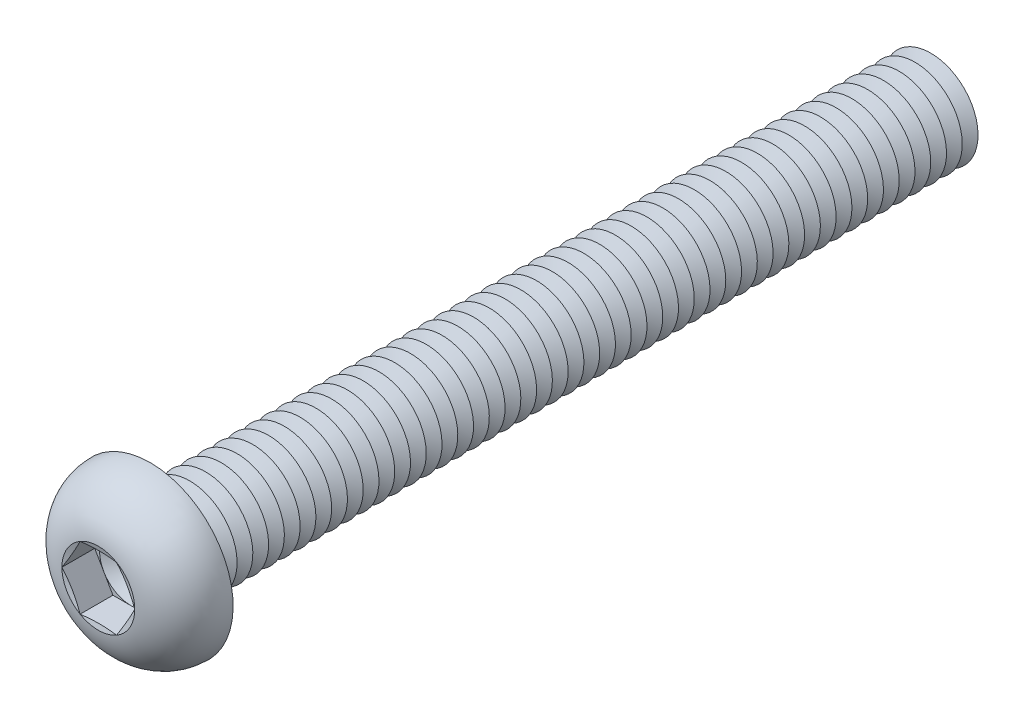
from build123d import *

# Parameters (mm, degrees)
FILLET1_R          = 0.5
LPATTERN1_COUNT    = 50
LPATTERN1_PITCH    = 1
CUT_EXTRUDE1_DEPTH = 2.08


with BuildPart() as part:
    # Sketch1 → Revolve1 (revolve)
    with BuildSketch(Plane(origin=(0, 0, 0), x_dir=(0, 0, -1), z_dir=(1, 0, 0))):
        with BuildLine():
            Line((0, 3), (0, 5.25))
            ThreePointArc((0, 5.25), (-2.210041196, 4.408189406), (-3.3, 2.3094))
            Line((-3.3, 2.3094), (-2.990599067, 1.1547))
            Line((-2.990599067, 1.1547), (-3.3, 1.1547))
            Line((-3.3, 1.1547), (-3.3, 0))
            Line((-3.3, 0), (50, 0))
            Line((50, 0), (50, 3))
            Line((50, 3), (0, 3))
        make_face()
    revolve(axis=Axis((0, 0, -50), (0, 0, 1)))

    # Fillet1
    fillet1_edges = [part.edges().sort_by_distance(p)[0] for p in [
        (0, -3, 0),
    ]]
    fillet(fillet1_edges, radius=FILLET1_R)

    # Sketch2 → Cut-Revolve1 (revolve, cut)
    with BuildSketch(Plane(origin=(0, 0, 0), x_dir=(0, 0, -1), z_dir=(1, 0, 0))):
        Polygon((49.5, 3), (50.5, 3), (50, 2.133974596), align=None)
    cut_revolve1 = revolve(axis=Axis((0, 0, -50), (0, 0, -1)), mode=Mode.SUBTRACT)

    # LPattern1: Cut-Revolve1 ×50
    with Locations(*[(0, 0, i * LPATTERN1_PITCH) for i in range(1, LPATTERN1_COUNT)]):
        add(cut_revolve1, mode=Mode.SUBTRACT)

    # Sketch3 → Cut-Extrude1 (cut)
    with BuildSketch(Plane.XY.offset(3.3)):
        Polygon((1.1547, 1.999999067), (-1.1547, 1.999999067), (-2.3094, 0), (-1.1547, -1.999999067), (1.1547, -1.999999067), (2.3094, 0), align=None)
    extrude(amount=-CUT_EXTRUDE1_DEPTH, mode=Mode.SUBTRACT)

    # Cut-Extrude2 cone 1 section (on through the dimple's axis) → Cut-Extrude2 (revolve, cut)
    with BuildSketch(Plane(origin=(0, 0, 1.22), x_dir=(0, -1, 0), z_dir=(1, 0, 0))):
        Polygon((0, 0), (1.999999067, 0), (0, 1.1547), align=None)
    revolve(axis=Axis((0, 0, 1.22), (0, 0, -1)), mode=Mode.SUBTRACT)


solid = part.part
